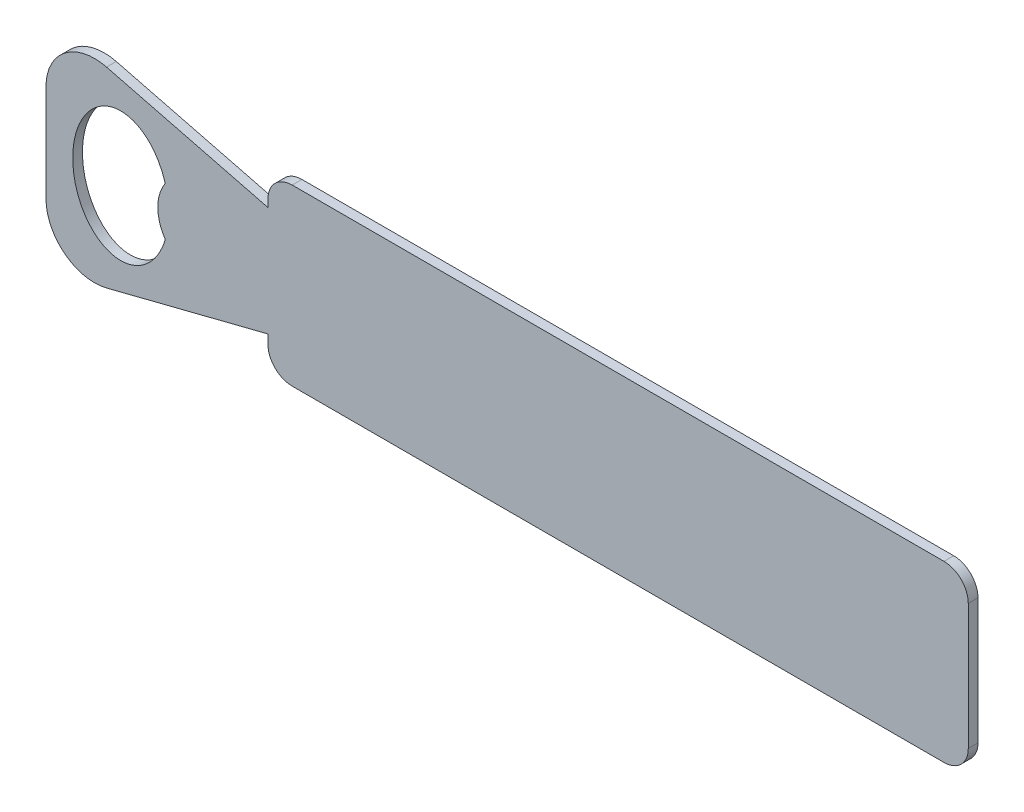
ISO-10303-21;
HEADER;
FILE_DESCRIPTION(('STEP AP214'),'2;1');
FILE_NAME('part.step','',(''),(''),'','','');
FILE_SCHEMA(('AUTOMOTIVE_DESIGN { 1 0 10303 214 1 1 1 1 }'));
ENDSEC;
DATA;
#1=APPLICATION_CONTEXT('core data for automotive mechanical design processes');
#2=APPLICATION_PROTOCOL_DEFINITION('international standard','automotive_design',2000,#1);
#3=PRODUCT_CONTEXT('',#1,'mechanical');
#4=PRODUCT('Part','Part','',(#3));
#5=PRODUCT_RELATED_PRODUCT_CATEGORY('part','',(#4));
#6=PRODUCT_DEFINITION_FORMATION('','',#4);
#7=PRODUCT_DEFINITION_CONTEXT('part definition',#1,'design');
#8=PRODUCT_DEFINITION('design','',#6,#7);
#9=PRODUCT_DEFINITION_SHAPE('','',#8);
#10=(LENGTH_UNIT() NAMED_UNIT(*) SI_UNIT(.MILLI.,.METRE.));
#11=(NAMED_UNIT(*) PLANE_ANGLE_UNIT() SI_UNIT($,.RADIAN.));
#12=(NAMED_UNIT(*) SI_UNIT($,.STERADIAN.) SOLID_ANGLE_UNIT());
#13=UNCERTAINTY_MEASURE_WITH_UNIT(LENGTH_MEASURE(1.E-05),#10,'distance_accuracy_value','');
#14=(GEOMETRIC_REPRESENTATION_CONTEXT(3) GLOBAL_UNCERTAINTY_ASSIGNED_CONTEXT((#13)) GLOBAL_UNIT_ASSIGNED_CONTEXT((#10,
#11,#12)) REPRESENTATION_CONTEXT('',''));
#15=CARTESIAN_POINT('',(0.,0.,0.));
#16=DIRECTION('',(0.,0.,1.));
#17=DIRECTION('',(1.,0.,0.));
#18=AXIS2_PLACEMENT_3D('',#15,#16,#17);
#19=CARTESIAN_POINT('',(-80.5423356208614,0.153345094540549,2.));
#20=DIRECTION('',(0.,0.,1.));
#21=DIRECTION('',(0.,1.,0.));
#22=AXIS2_PLACEMENT_3D('',#19,#20,#21);
#23=ELLIPSE('',#22,13.3439088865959,9.88507384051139);
#24=DIRECTION('',(0.,0.,-1.));
#25=VECTOR('',#24,1.);
#26=SURFACE_OF_LINEAR_EXTRUSION('',#23,#25);
#27=CARTESIAN_POINT('',(-80.5423356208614,0.153345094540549,0.));
#28=DIRECTION('',(0.,0.,1.));
#29=DIRECTION('',(0.,1.,0.));
#30=AXIS2_PLACEMENT_3D('',#27,#28,#29);
#31=ELLIPSE('',#30,13.3439088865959,9.88507384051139);
#32=CARTESIAN_POINT('',(-71.375707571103,5.1475578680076,0.));
#33=VERTEX_POINT('',#32);
#34=CARTESIAN_POINT('',(-71.375707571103,-4.84086767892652,0.));
#35=VERTEX_POINT('',#34);
#36=EDGE_CURVE('E154',#33,#35,#31,.T.);
#37=ORIENTED_EDGE('',*,*,#36,.F.);
#38=DIRECTION('',(0.,0.,-1.));
#39=VECTOR('',#38,1.);
#40=CARTESIAN_POINT('',(-71.375707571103,5.1475578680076,2.));
#41=LINE('',#40,#39);
#42=CARTESIAN_POINT('',(-71.375707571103,5.14755786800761,2.));
#43=VERTEX_POINT('',#42);
#44=EDGE_CURVE('E11',#33,#43,#41,.F.);
#45=ORIENTED_EDGE('',*,*,#44,.T.);
#46=CARTESIAN_POINT('',(-71.375707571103,-4.84086767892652,2.));
#47=VERTEX_POINT('',#46);
#48=EDGE_CURVE('E156',#43,#47,#23,.T.);
#49=ORIENTED_EDGE('',*,*,#48,.T.);
#50=DIRECTION('',(0.,0.,-1.));
#51=VECTOR('',#50,1.);
#52=CARTESIAN_POINT('',(-71.375707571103,-4.84086767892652,2.));
#53=LINE('',#52,#51);
#54=EDGE_CURVE('E42',#47,#35,#53,.T.);
#55=ORIENTED_EDGE('',*,*,#54,.T.);
#56=EDGE_LOOP('',(#37,#45,#49,#55));
#57=FACE_BOUND('',#56,.T.);
#58=ADVANCED_FACE('F34',(#57),#26,.T.);
#59=CARTESIAN_POINT('',(88.9051595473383,12.9254230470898,2.));
#60=DIRECTION('',(0.,0.,-1.));
#61=DIRECTION('',(-1.,0.,0.));
#62=AXIS2_PLACEMENT_3D('',#59,#60,#61);
#63=PLANE('',#62);
#64=CARTESIAN_POINT('',(-64.0644688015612,0.153345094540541,2.));
#65=DIRECTION('',(0.,0.,1.));
#66=DIRECTION('',(1.,0.,0.));
#67=AXIS2_PLACEMENT_3D('',#64,#65,#66);
#68=CIRCLE('',#67,8.854172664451);
#69=EDGE_CURVE('E150',#43,#47,#68,.T.);
#70=ORIENTED_EDGE('',*,*,#69,.T.);
#71=ORIENTED_EDGE('',*,*,#48,.F.);
#72=EDGE_LOOP('',(#70,#71));
#73=FACE_BOUND('',#72,.T.);
#74=DIRECTION('',(0.,-1.,0.));
#75=VECTOR('',#74,1.);
#76=CARTESIAN_POINT('',(-50.25407239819,12.9254230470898,2.));
#77=LINE('',#76,#75);
#78=CARTESIAN_POINT('',(-50.25407239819,12.9254230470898,2.));
#79=VERTEX_POINT('',#78);
#80=CARTESIAN_POINT('',(-50.25407239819,11.42453888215,2.));
#81=VERTEX_POINT('',#80);
#82=EDGE_CURVE('E215',#79,#81,#77,.T.);
#83=ORIENTED_EDGE('',*,*,#82,.T.);
#84=DIRECTION('',(-0.969329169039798,0.245766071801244,0.));
#85=VECTOR('',#84,1.);
#86=CARTESIAN_POINT('',(-5.79920998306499,0.153345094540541,2.));
#87=LINE('',#86,#85);
#88=CARTESIAN_POINT('',(-83.4717785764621,19.8466367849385,2.));
#89=VERTEX_POINT('',#88);
#90=EDGE_CURVE('E177',#81,#89,#87,.T.);
#91=ORIENTED_EDGE('',*,*,#90,.T.);
#92=CARTESIAN_POINT('',(-85.9294392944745,10.1533450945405,2.));
#93=DIRECTION('',(0.,0.,1.));
#94=DIRECTION('',(1.,0.,0.));
#95=AXIS2_PLACEMENT_3D('',#92,#93,#94);
#96=CIRCLE('',#95,10.);
#97=CARTESIAN_POINT('',(-95.9294392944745,10.1533450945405,2.));
#98=VERTEX_POINT('',#97);
#99=EDGE_CURVE('E166',#89,#98,#96,.T.);
#100=ORIENTED_EDGE('',*,*,#99,.T.);
#101=DIRECTION('',(0.,-1.,0.));
#102=VECTOR('',#101,1.);
#103=CARTESIAN_POINT('',(-95.9294392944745,10.1533450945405,2.));
#104=LINE('',#103,#102);
#105=CARTESIAN_POINT('',(-95.9294392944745,-9.84665490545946,2.));
#106=VERTEX_POINT('',#105);
#107=EDGE_CURVE('E169',#98,#106,#104,.T.);
#108=ORIENTED_EDGE('',*,*,#107,.T.);
#109=CARTESIAN_POINT('',(-85.9294392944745,-9.84665490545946,2.));
#110=DIRECTION('',(0.,0.,1.));
#111=DIRECTION('',(-1.,0.,0.));
#112=AXIS2_PLACEMENT_3D('',#109,#110,#111);
#113=CIRCLE('',#112,10.);
#114=CARTESIAN_POINT('',(-83.4717785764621,-19.5399465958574,2.));
#115=VERTEX_POINT('',#114);
#116=EDGE_CURVE('E172',#106,#115,#113,.T.);
#117=ORIENTED_EDGE('',*,*,#116,.T.);
#118=DIRECTION('',(0.969329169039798,0.245766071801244,0.));
#119=VECTOR('',#118,1.);
#120=CARTESIAN_POINT('',(-5.79920998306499,0.153345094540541,2.));
#121=LINE('',#120,#119);
#122=CARTESIAN_POINT('',(-50.2540723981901,-11.1178486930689,2.));
#123=VERTEX_POINT('',#122);
#124=EDGE_CURVE('E174',#115,#123,#121,.T.);
#125=ORIENTED_EDGE('',*,*,#124,.T.);
#126=CARTESIAN_POINT('',(-50.25407239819,-12.9254230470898,2.));
#127=VERTEX_POINT('',#126);
#128=EDGE_CURVE('E56',#123,#127,#77,.T.);
#129=ORIENTED_EDGE('',*,*,#128,.T.);
#130=CARTESIAN_POINT('',(-45.25407239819,-12.9254230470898,2.));
#131=DIRECTION('',(0.,0.,1.));
#132=DIRECTION('',(1.,0.,0.));
#133=AXIS2_PLACEMENT_3D('',#130,#131,#132);
#134=CIRCLE('',#133,5.);
#135=CARTESIAN_POINT('',(-45.25407239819,-17.9254230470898,2.));
#136=VERTEX_POINT('',#135);
#137=EDGE_CURVE('E218',#127,#136,#134,.T.);
#138=ORIENTED_EDGE('',*,*,#137,.T.);
#139=DIRECTION('',(1.,0.,0.));
#140=VECTOR('',#139,1.);
#141=CARTESIAN_POINT('',(-45.25407239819,-17.9254230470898,2.));
#142=LINE('',#141,#140);
#143=CARTESIAN_POINT('',(88.9051595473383,-17.9254230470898,2.));
#144=VERTEX_POINT('',#143);
#145=EDGE_CURVE('E220',#136,#144,#142,.T.);
#146=ORIENTED_EDGE('',*,*,#145,.T.);
#147=CARTESIAN_POINT('',(88.9051595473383,-12.9254230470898,2.));
#148=DIRECTION('',(0.,0.,1.));
#149=DIRECTION('',(1.,0.,0.));
#150=AXIS2_PLACEMENT_3D('',#147,#148,#149);
#151=CIRCLE('',#150,5.);
#152=CARTESIAN_POINT('',(93.9051595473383,-12.9254230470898,2.));
#153=VERTEX_POINT('',#152);
#154=EDGE_CURVE('E222',#144,#153,#151,.T.);
#155=ORIENTED_EDGE('',*,*,#154,.T.);
#156=DIRECTION('',(0.,1.,0.));
#157=VECTOR('',#156,1.);
#158=CARTESIAN_POINT('',(93.9051595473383,12.9254230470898,2.));
#159=LINE('',#158,#157);
#160=CARTESIAN_POINT('',(93.9051595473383,12.9254230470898,2.));
#161=VERTEX_POINT('',#160);
#162=EDGE_CURVE('E224',#153,#161,#159,.T.);
#163=ORIENTED_EDGE('',*,*,#162,.T.);
#164=CARTESIAN_POINT('',(88.9051595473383,12.9254230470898,2.));
#165=DIRECTION('',(0.,0.,1.));
#166=DIRECTION('',(-1.,0.,0.));
#167=AXIS2_PLACEMENT_3D('',#164,#165,#166);
#168=CIRCLE('',#167,5.);
#169=CARTESIAN_POINT('',(88.9051595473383,17.9254230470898,2.));
#170=VERTEX_POINT('',#169);
#171=EDGE_CURVE('E207',#161,#170,#168,.T.);
#172=ORIENTED_EDGE('',*,*,#171,.T.);
#173=DIRECTION('',(-1.,0.,0.));
#174=VECTOR('',#173,1.);
#175=CARTESIAN_POINT('',(-45.25407239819,17.9254230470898,2.));
#176=LINE('',#175,#174);
#177=CARTESIAN_POINT('',(-45.25407239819,17.9254230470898,2.));
#178=VERTEX_POINT('',#177);
#179=EDGE_CURVE('E210',#170,#178,#176,.T.);
#180=ORIENTED_EDGE('',*,*,#179,.T.);
#181=CARTESIAN_POINT('',(-45.25407239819,12.9254230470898,2.));
#182=DIRECTION('',(0.,0.,1.));
#183=DIRECTION('',(1.,0.,0.));
#184=AXIS2_PLACEMENT_3D('',#181,#182,#183);
#185=CIRCLE('',#184,5.);
#186=EDGE_CURVE('E213',#178,#79,#185,.T.);
#187=ORIENTED_EDGE('',*,*,#186,.T.);
#188=EDGE_LOOP('',(#83,#91,#100,#108,#117,#125,#129,#138,#146,#155,#163,#172,#180,#187));
#189=FACE_BOUND('',#188,.T.);
#190=ADVANCED_FACE('F286',(#73,#189),#63,.F.);
#191=CARTESIAN_POINT('',(88.9051595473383,12.9254230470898,0.));
#192=DIRECTION('',(0.,0.,-1.));
#193=DIRECTION('',(-1.,0.,0.));
#194=AXIS2_PLACEMENT_3D('',#191,#192,#193);
#195=PLANE('',#194);
#196=CARTESIAN_POINT('',(-64.0644688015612,0.153345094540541,0.));
#197=DIRECTION('',(0.,0.,1.));
#198=DIRECTION('',(1.,0.,0.));
#199=AXIS2_PLACEMENT_3D('',#196,#197,#198);
#200=CIRCLE('',#199,8.854172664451);
#201=EDGE_CURVE('E48',#33,#35,#200,.T.);
#202=ORIENTED_EDGE('',*,*,#201,.F.);
#203=ORIENTED_EDGE('',*,*,#36,.T.);
#204=EDGE_LOOP('',(#202,#203));
#205=FACE_BOUND('',#204,.T.);
#206=DIRECTION('',(0.,-1.,0.));
#207=VECTOR('',#206,1.);
#208=CARTESIAN_POINT('',(-50.25407239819,12.9254230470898,0.));
#209=LINE('',#208,#207);
#210=CARTESIAN_POINT('',(-50.25407239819,-11.1178486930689,0.));
#211=VERTEX_POINT('',#210);
#212=CARTESIAN_POINT('',(-50.25407239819,-12.9254230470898,0.));
#213=VERTEX_POINT('',#212);
#214=EDGE_CURVE('E233',#211,#213,#209,.T.);
#215=ORIENTED_EDGE('',*,*,#214,.F.);
#216=DIRECTION('',(0.969329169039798,0.245766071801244,0.));
#217=VECTOR('',#216,1.);
#218=CARTESIAN_POINT('',(-5.79920998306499,0.153345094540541,0.));
#219=LINE('',#218,#217);
#220=CARTESIAN_POINT('',(-83.4717785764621,-19.5399465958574,0.));
#221=VERTEX_POINT('',#220);
#222=EDGE_CURVE('E186',#221,#211,#219,.T.);
#223=ORIENTED_EDGE('',*,*,#222,.F.);
#224=CARTESIAN_POINT('',(-85.9294392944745,-9.84665490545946,0.));
#225=DIRECTION('',(0.,0.,1.));
#226=DIRECTION('',(-1.,0.,0.));
#227=AXIS2_PLACEMENT_3D('',#224,#225,#226);
#228=CIRCLE('',#227,10.);
#229=CARTESIAN_POINT('',(-95.9294392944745,-9.84665490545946,0.));
#230=VERTEX_POINT('',#229);
#231=EDGE_CURVE('E184',#230,#221,#228,.T.);
#232=ORIENTED_EDGE('',*,*,#231,.F.);
#233=DIRECTION('',(0.,-1.,0.));
#234=VECTOR('',#233,1.);
#235=CARTESIAN_POINT('',(-95.9294392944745,10.1533450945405,0.));
#236=LINE('',#235,#234);
#237=CARTESIAN_POINT('',(-95.9294392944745,10.1533450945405,0.));
#238=VERTEX_POINT('',#237);
#239=EDGE_CURVE('E182',#238,#230,#236,.T.);
#240=ORIENTED_EDGE('',*,*,#239,.F.);
#241=CARTESIAN_POINT('',(-85.9294392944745,10.1533450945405,0.));
#242=DIRECTION('',(0.,0.,1.));
#243=DIRECTION('',(1.,0.,0.));
#244=AXIS2_PLACEMENT_3D('',#241,#242,#243);
#245=CIRCLE('',#244,10.);
#246=CARTESIAN_POINT('',(-83.4717785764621,19.8466367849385,0.));
#247=VERTEX_POINT('',#246);
#248=EDGE_CURVE('E161',#247,#238,#245,.T.);
#249=ORIENTED_EDGE('',*,*,#248,.F.);
#250=DIRECTION('',(-0.969329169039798,0.245766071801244,0.));
#251=VECTOR('',#250,1.);
#252=CARTESIAN_POINT('',(-5.79920998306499,0.153345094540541,0.));
#253=LINE('',#252,#251);
#254=CARTESIAN_POINT('',(-50.25407239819,11.42453888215,0.));
#255=VERTEX_POINT('',#254);
#256=EDGE_CURVE('E170',#255,#247,#253,.T.);
#257=ORIENTED_EDGE('',*,*,#256,.F.);
#258=CARTESIAN_POINT('',(-50.25407239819,12.9254230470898,0.));
#259=VERTEX_POINT('',#258);
#260=EDGE_CURVE('E234',#259,#255,#209,.T.);
#261=ORIENTED_EDGE('',*,*,#260,.F.);
#262=CARTESIAN_POINT('',(-45.25407239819,12.9254230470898,0.));
#263=DIRECTION('',(0.,0.,1.));
#264=DIRECTION('',(1.,0.,0.));
#265=AXIS2_PLACEMENT_3D('',#262,#263,#264);
#266=CIRCLE('',#265,5.);
#267=CARTESIAN_POINT('',(-45.25407239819,17.9254230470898,0.));
#268=VERTEX_POINT('',#267);
#269=EDGE_CURVE('E231',#268,#259,#266,.T.);
#270=ORIENTED_EDGE('',*,*,#269,.F.);
#271=DIRECTION('',(-1.,0.,0.));
#272=VECTOR('',#271,1.);
#273=CARTESIAN_POINT('',(-45.25407239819,17.9254230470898,0.));
#274=LINE('',#273,#272);
#275=CARTESIAN_POINT('',(88.9051595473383,17.9254230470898,0.));
#276=VERTEX_POINT('',#275);
#277=EDGE_CURVE('E229',#276,#268,#274,.T.);
#278=ORIENTED_EDGE('',*,*,#277,.F.);
#279=CARTESIAN_POINT('',(88.9051595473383,12.9254230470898,0.));
#280=DIRECTION('',(0.,0.,1.));
#281=DIRECTION('',(-1.,0.,0.));
#282=AXIS2_PLACEMENT_3D('',#279,#280,#281);
#283=CIRCLE('',#282,5.);
#284=CARTESIAN_POINT('',(93.9051595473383,12.9254230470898,0.));
#285=VERTEX_POINT('',#284);
#286=EDGE_CURVE('E206',#285,#276,#283,.T.);
#287=ORIENTED_EDGE('',*,*,#286,.F.);
#288=DIRECTION('',(0.,1.,0.));
#289=VECTOR('',#288,1.);
#290=CARTESIAN_POINT('',(93.9051595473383,12.9254230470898,0.));
#291=LINE('',#290,#289);
#292=CARTESIAN_POINT('',(93.9051595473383,-12.9254230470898,0.));
#293=VERTEX_POINT('',#292);
#294=EDGE_CURVE('E211',#293,#285,#291,.T.);
#295=ORIENTED_EDGE('',*,*,#294,.F.);
#296=CARTESIAN_POINT('',(88.9051595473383,-12.9254230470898,0.));
#297=DIRECTION('',(0.,0.,1.));
#298=DIRECTION('',(1.,0.,0.));
#299=AXIS2_PLACEMENT_3D('',#296,#297,#298);
#300=CIRCLE('',#299,5.);
#301=CARTESIAN_POINT('',(88.9051595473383,-17.9254230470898,0.));
#302=VERTEX_POINT('',#301);
#303=EDGE_CURVE('E240',#302,#293,#300,.T.);
#304=ORIENTED_EDGE('',*,*,#303,.F.);
#305=DIRECTION('',(1.,0.,0.));
#306=VECTOR('',#305,1.);
#307=CARTESIAN_POINT('',(-45.25407239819,-17.9254230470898,0.));
#308=LINE('',#307,#306);
#309=CARTESIAN_POINT('',(-45.25407239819,-17.9254230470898,0.));
#310=VERTEX_POINT('',#309);
#311=EDGE_CURVE('E238',#310,#302,#308,.T.);
#312=ORIENTED_EDGE('',*,*,#311,.F.);
#313=CARTESIAN_POINT('',(-45.25407239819,-12.9254230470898,0.));
#314=DIRECTION('',(0.,0.,1.));
#315=DIRECTION('',(1.,0.,0.));
#316=AXIS2_PLACEMENT_3D('',#313,#314,#315);
#317=CIRCLE('',#316,5.);
#318=EDGE_CURVE('E236',#213,#310,#317,.T.);
#319=ORIENTED_EDGE('',*,*,#318,.F.);
#320=EDGE_LOOP('',(#215,#223,#232,#240,#249,#257,#261,#270,#278,#287,#295,#304,#312,#319));
#321=FACE_BOUND('',#320,.T.);
#322=ADVANCED_FACE('F158',(#205,#321),#195,.T.);
#323=CARTESIAN_POINT('',(-50.25407239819,12.9254230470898,2.));
#324=DIRECTION('',(1.,0.,0.));
#325=DIRECTION('',(0.,0.,-1.));
#326=AXIS2_PLACEMENT_3D('',#323,#324,#325);
#327=PLANE('',#326);
#328=DIRECTION('',(0.,0.,1.));
#329=VECTOR('',#328,1.);
#330=CARTESIAN_POINT('',(-50.25407239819,-11.1178486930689,2.));
#331=LINE('',#330,#329);
#332=EDGE_CURVE('E204',#211,#123,#331,.T.);
#333=ORIENTED_EDGE('',*,*,#332,.F.);
#334=ORIENTED_EDGE('',*,*,#214,.T.);
#335=DIRECTION('',(0.,0.,-1.));
#336=VECTOR('',#335,1.);
#337=CARTESIAN_POINT('',(-50.25407239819,-12.9254230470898,2.));
#338=LINE('',#337,#336);
#339=EDGE_CURVE('E254',#127,#213,#338,.T.);
#340=ORIENTED_EDGE('',*,*,#339,.F.);
#341=ORIENTED_EDGE('',*,*,#128,.F.);
#342=EDGE_LOOP('',(#333,#334,#340,#341));
#343=FACE_BOUND('',#342,.T.);
#344=ADVANCED_FACE('F309',(#343),#327,.F.);
#345=DIRECTION('',(0.,0.,-1.));
#346=VECTOR('',#345,1.);
#347=CARTESIAN_POINT('',(-50.25407239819,11.42453888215,2.));
#348=LINE('',#347,#346);
#349=EDGE_CURVE('E201',#81,#255,#348,.T.);
#350=ORIENTED_EDGE('',*,*,#349,.F.);
#351=ORIENTED_EDGE('',*,*,#82,.F.);
#352=DIRECTION('',(0.,0.,-1.));
#353=VECTOR('',#352,1.);
#354=CARTESIAN_POINT('',(-50.25407239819,12.9254230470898,2.));
#355=LINE('',#354,#353);
#356=EDGE_CURVE('E257',#79,#259,#355,.T.);
#357=ORIENTED_EDGE('',*,*,#356,.T.);
#358=ORIENTED_EDGE('',*,*,#260,.T.);
#359=EDGE_LOOP('',(#350,#351,#357,#358));
#360=FACE_BOUND('',#359,.T.);
#361=ADVANCED_FACE('F283',(#360),#327,.F.);
#362=CARTESIAN_POINT('',(88.9051595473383,12.9254230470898,2.));
#363=DIRECTION('',(0.,0.,-1.));
#364=DIRECTION('',(-1.,0.,0.));
#365=AXIS2_PLACEMENT_3D('',#362,#363,#364);
#366=CYLINDRICAL_SURFACE('',#365,5.);
#367=ORIENTED_EDGE('',*,*,#286,.T.);
#368=DIRECTION('',(0.,0.,-1.));
#369=VECTOR('',#368,1.);
#370=CARTESIAN_POINT('',(88.9051595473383,17.9254230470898,2.));
#371=LINE('',#370,#369);
#372=EDGE_CURVE('E157',#170,#276,#371,.T.);
#373=ORIENTED_EDGE('',*,*,#372,.F.);
#374=ORIENTED_EDGE('',*,*,#171,.F.);
#375=DIRECTION('',(0.,0.,-1.));
#376=VECTOR('',#375,1.);
#377=CARTESIAN_POINT('',(93.9051595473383,12.9254230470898,2.));
#378=LINE('',#377,#376);
#379=EDGE_CURVE('E226',#161,#285,#378,.T.);
#380=ORIENTED_EDGE('',*,*,#379,.T.);
#381=EDGE_LOOP('',(#367,#373,#374,#380));
#382=FACE_BOUND('',#381,.T.);
#383=ADVANCED_FACE('F36',(#382),#366,.T.);
#384=CARTESIAN_POINT('',(-45.25407239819,17.9254230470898,2.));
#385=DIRECTION('',(0.,-1.,0.));
#386=DIRECTION('',(0.,0.,-1.));
#387=AXIS2_PLACEMENT_3D('',#384,#385,#386);
#388=PLANE('',#387);
#389=ORIENTED_EDGE('',*,*,#277,.T.);
#390=DIRECTION('',(0.,0.,-1.));
#391=VECTOR('',#390,1.);
#392=CARTESIAN_POINT('',(-45.25407239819,17.9254230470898,2.));
#393=LINE('',#392,#391);
#394=EDGE_CURVE('E260',#178,#268,#393,.T.);
#395=ORIENTED_EDGE('',*,*,#394,.F.);
#396=ORIENTED_EDGE('',*,*,#179,.F.);
#397=ORIENTED_EDGE('',*,*,#372,.T.);
#398=EDGE_LOOP('',(#389,#395,#396,#397));
#399=FACE_BOUND('',#398,.T.);
#400=ADVANCED_FACE('F266',(#399),#388,.F.);
#401=CARTESIAN_POINT('',(-45.25407239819,12.9254230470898,2.));
#402=DIRECTION('',(0.,0.,-1.));
#403=DIRECTION('',(-1.,0.,0.));
#404=AXIS2_PLACEMENT_3D('',#401,#402,#403);
#405=CYLINDRICAL_SURFACE('',#404,5.);
#406=ORIENTED_EDGE('',*,*,#269,.T.);
#407=ORIENTED_EDGE('',*,*,#356,.F.);
#408=ORIENTED_EDGE('',*,*,#186,.F.);
#409=ORIENTED_EDGE('',*,*,#394,.T.);
#410=EDGE_LOOP('',(#406,#407,#408,#409));
#411=FACE_BOUND('',#410,.T.);
#412=ADVANCED_FACE('F279',(#411),#405,.T.);
#413=CARTESIAN_POINT('',(-45.25407239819,-12.9254230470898,2.));
#414=DIRECTION('',(0.,0.,-1.));
#415=DIRECTION('',(-1.,0.,0.));
#416=AXIS2_PLACEMENT_3D('',#413,#414,#415);
#417=CYLINDRICAL_SURFACE('',#416,5.);
#418=ORIENTED_EDGE('',*,*,#318,.T.);
#419=DIRECTION('',(0.,0.,-1.));
#420=VECTOR('',#419,1.);
#421=CARTESIAN_POINT('',(-45.25407239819,-17.9254230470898,2.));
#422=LINE('',#421,#420);
#423=EDGE_CURVE('E251',#136,#310,#422,.T.);
#424=ORIENTED_EDGE('',*,*,#423,.F.);
#425=ORIENTED_EDGE('',*,*,#137,.F.);
#426=ORIENTED_EDGE('',*,*,#339,.T.);
#427=EDGE_LOOP('',(#418,#424,#425,#426));
#428=FACE_BOUND('',#427,.T.);
#429=ADVANCED_FACE('F312',(#428),#417,.T.);
#430=CARTESIAN_POINT('',(-45.25407239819,-17.9254230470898,2.));
#431=DIRECTION('',(0.,1.,0.));
#432=DIRECTION('',(0.,0.,1.));
#433=AXIS2_PLACEMENT_3D('',#430,#431,#432);
#434=PLANE('',#433);
#435=ORIENTED_EDGE('',*,*,#311,.T.);
#436=DIRECTION('',(0.,0.,-1.));
#437=VECTOR('',#436,1.);
#438=CARTESIAN_POINT('',(88.9051595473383,-17.9254230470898,2.));
#439=LINE('',#438,#437);
#440=EDGE_CURVE('E248',#144,#302,#439,.T.);
#441=ORIENTED_EDGE('',*,*,#440,.F.);
#442=ORIENTED_EDGE('',*,*,#145,.F.);
#443=ORIENTED_EDGE('',*,*,#423,.T.);
#444=EDGE_LOOP('',(#435,#441,#442,#443));
#445=FACE_BOUND('',#444,.T.);
#446=ADVANCED_FACE('F317',(#445),#434,.F.);
#447=CARTESIAN_POINT('',(88.9051595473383,-12.9254230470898,2.));
#448=DIRECTION('',(0.,0.,-1.));
#449=DIRECTION('',(-1.,0.,0.));
#450=AXIS2_PLACEMENT_3D('',#447,#448,#449);
#451=CYLINDRICAL_SURFACE('',#450,5.);
#452=ORIENTED_EDGE('',*,*,#303,.T.);
#453=DIRECTION('',(0.,0.,-1.));
#454=VECTOR('',#453,1.);
#455=CARTESIAN_POINT('',(93.9051595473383,-12.9254230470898,2.));
#456=LINE('',#455,#454);
#457=EDGE_CURVE('E245',#153,#293,#456,.T.);
#458=ORIENTED_EDGE('',*,*,#457,.F.);
#459=ORIENTED_EDGE('',*,*,#154,.F.);
#460=ORIENTED_EDGE('',*,*,#440,.T.);
#461=EDGE_LOOP('',(#452,#458,#459,#460));
#462=FACE_BOUND('',#461,.T.);
#463=ADVANCED_FACE('F322',(#462),#451,.T.);
#464=CARTESIAN_POINT('',(93.9051595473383,12.9254230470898,2.));
#465=DIRECTION('',(-1.,0.,0.));
#466=DIRECTION('',(0.,0.,1.));
#467=AXIS2_PLACEMENT_3D('',#464,#465,#466);
#468=PLANE('',#467);
#469=ORIENTED_EDGE('',*,*,#294,.T.);
#470=ORIENTED_EDGE('',*,*,#379,.F.);
#471=ORIENTED_EDGE('',*,*,#162,.F.);
#472=ORIENTED_EDGE('',*,*,#457,.T.);
#473=EDGE_LOOP('',(#469,#470,#471,#472));
#474=FACE_BOUND('',#473,.T.);
#475=ADVANCED_FACE('F324',(#474),#468,.F.);
#476=CARTESIAN_POINT('',(-5.79920998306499,0.153345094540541,2.));
#477=DIRECTION('',(-0.245766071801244,0.969329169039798,0.));
#478=DIRECTION('',(-0.969329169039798,-0.245766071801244,0.));
#479=AXIS2_PLACEMENT_3D('',#476,#477,#478);
#480=PLANE('',#479);
#481=ORIENTED_EDGE('',*,*,#222,.T.);
#482=ORIENTED_EDGE('',*,*,#332,.T.);
#483=ORIENTED_EDGE('',*,*,#124,.F.);
#484=DIRECTION('',(0.,0.,-1.));
#485=VECTOR('',#484,1.);
#486=CARTESIAN_POINT('',(-83.4717785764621,-19.5399465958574,2.));
#487=LINE('',#486,#485);
#488=EDGE_CURVE('E192',#115,#221,#487,.T.);
#489=ORIENTED_EDGE('',*,*,#488,.T.);
#490=EDGE_LOOP('',(#481,#482,#483,#489));
#491=FACE_BOUND('',#490,.T.);
#492=ADVANCED_FACE('F306',(#491),#480,.F.);
#493=CARTESIAN_POINT('',(-5.79920998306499,0.153345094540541,2.));
#494=DIRECTION('',(-0.245766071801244,-0.969329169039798,0.));
#495=DIRECTION('',(0.969329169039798,-0.245766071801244,0.));
#496=AXIS2_PLACEMENT_3D('',#493,#494,#495);
#497=PLANE('',#496);
#498=ORIENTED_EDGE('',*,*,#90,.F.);
#499=ORIENTED_EDGE('',*,*,#349,.T.);
#500=ORIENTED_EDGE('',*,*,#256,.T.);
#501=DIRECTION('',(0.,0.,-1.));
#502=VECTOR('',#501,1.);
#503=CARTESIAN_POINT('',(-83.4717785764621,19.8466367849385,2.));
#504=LINE('',#503,#502);
#505=EDGE_CURVE('E179',#89,#247,#504,.T.);
#506=ORIENTED_EDGE('',*,*,#505,.F.);
#507=EDGE_LOOP('',(#498,#499,#500,#506));
#508=FACE_BOUND('',#507,.T.);
#509=ADVANCED_FACE('F289',(#508),#497,.F.);
#510=CARTESIAN_POINT('',(-85.9294392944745,10.1533450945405,2.));
#511=DIRECTION('',(0.,0.,-1.));
#512=DIRECTION('',(-1.,0.,0.));
#513=AXIS2_PLACEMENT_3D('',#510,#511,#512);
#514=CYLINDRICAL_SURFACE('',#513,10.);
#515=ORIENTED_EDGE('',*,*,#248,.T.);
#516=DIRECTION('',(0.,0.,-1.));
#517=VECTOR('',#516,1.);
#518=CARTESIAN_POINT('',(-95.9294392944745,10.1533450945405,2.));
#519=LINE('',#518,#517);
#520=EDGE_CURVE('E198',#98,#238,#519,.T.);
#521=ORIENTED_EDGE('',*,*,#520,.F.);
#522=ORIENTED_EDGE('',*,*,#99,.F.);
#523=ORIENTED_EDGE('',*,*,#505,.T.);
#524=EDGE_LOOP('',(#515,#521,#522,#523));
#525=FACE_BOUND('',#524,.T.);
#526=ADVANCED_FACE('F294',(#525),#514,.T.);
#527=CARTESIAN_POINT('',(-95.9294392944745,10.1533450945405,2.));
#528=DIRECTION('',(1.,0.,0.));
#529=DIRECTION('',(0.,0.,-1.));
#530=AXIS2_PLACEMENT_3D('',#527,#528,#529);
#531=PLANE('',#530);
#532=ORIENTED_EDGE('',*,*,#239,.T.);
#533=DIRECTION('',(0.,0.,-1.));
#534=VECTOR('',#533,1.);
#535=CARTESIAN_POINT('',(-95.9294392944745,-9.84665490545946,2.));
#536=LINE('',#535,#534);
#537=EDGE_CURVE('E195',#106,#230,#536,.T.);
#538=ORIENTED_EDGE('',*,*,#537,.F.);
#539=ORIENTED_EDGE('',*,*,#107,.F.);
#540=ORIENTED_EDGE('',*,*,#520,.T.);
#541=EDGE_LOOP('',(#532,#538,#539,#540));
#542=FACE_BOUND('',#541,.T.);
#543=ADVANCED_FACE('F299',(#542),#531,.F.);
#544=CARTESIAN_POINT('',(-85.9294392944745,-9.84665490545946,2.));
#545=DIRECTION('',(0.,0.,-1.));
#546=DIRECTION('',(-1.,0.,0.));
#547=AXIS2_PLACEMENT_3D('',#544,#545,#546);
#548=CYLINDRICAL_SURFACE('',#547,10.);
#549=ORIENTED_EDGE('',*,*,#231,.T.);
#550=ORIENTED_EDGE('',*,*,#488,.F.);
#551=ORIENTED_EDGE('',*,*,#116,.F.);
#552=ORIENTED_EDGE('',*,*,#537,.T.);
#553=EDGE_LOOP('',(#549,#550,#551,#552));
#554=FACE_BOUND('',#553,.T.);
#555=ADVANCED_FACE('F302',(#554),#548,.T.);
#556=CARTESIAN_POINT('',(-64.0644688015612,0.153345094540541,2.));
#557=DIRECTION('',(0.,0.,-1.));
#558=DIRECTION('',(-1.,0.,0.));
#559=AXIS2_PLACEMENT_3D('',#556,#557,#558);
#560=CYLINDRICAL_SURFACE('',#559,8.854172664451);
#561=ORIENTED_EDGE('',*,*,#44,.F.);
#562=ORIENTED_EDGE('',*,*,#201,.T.);
#563=ORIENTED_EDGE('',*,*,#54,.F.);
#564=ORIENTED_EDGE('',*,*,#69,.F.);
#565=EDGE_LOOP('',(#561,#562,#563,#564));
#566=FACE_BOUND('',#565,.T.);
#567=ADVANCED_FACE('F147',(#566),#560,.T.);
#568=CLOSED_SHELL('',(#58,#190,#322,#344,#361,#383,#400,#412,#429,#446,#463,#475,#492,#509,#526,
#543,#555,#567));
#569=MANIFOLD_SOLID_BREP('B2',#568);
#570=ADVANCED_BREP_SHAPE_REPRESENTATION('',(#18,#569),#14);
#571=SHAPE_DEFINITION_REPRESENTATION(#9,#570);
ENDSEC;
END-ISO-10303-21;
